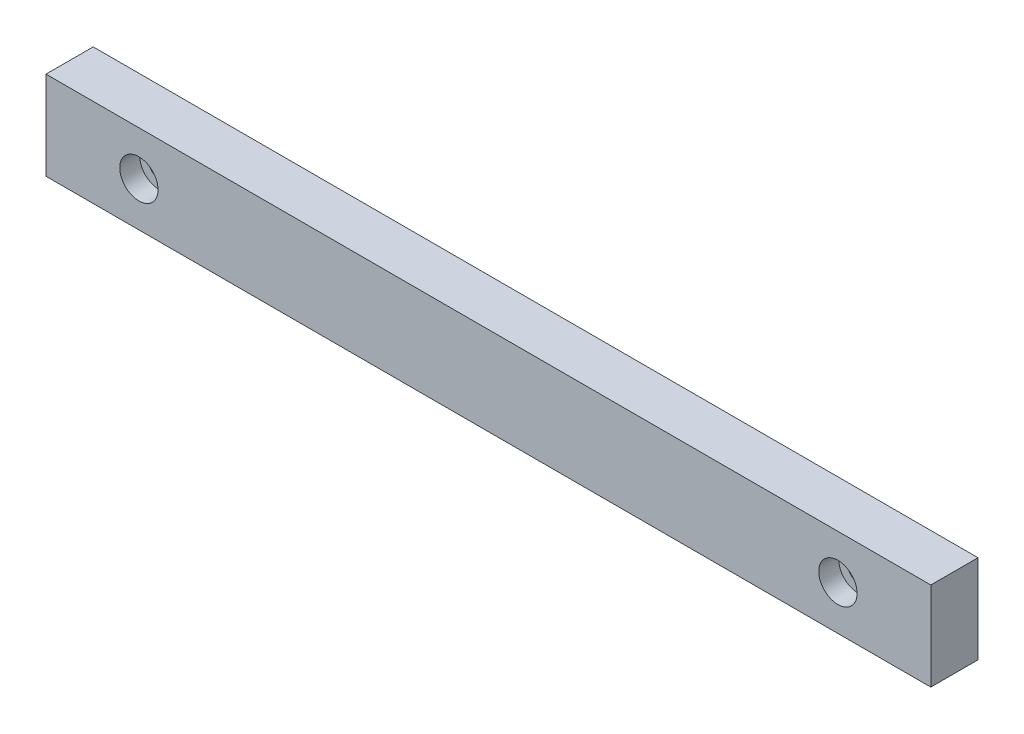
ISO-10303-21;
HEADER;
FILE_DESCRIPTION(('STEP AP214'),'2;1');
FILE_NAME('part.step','',(''),(''),'','','');
FILE_SCHEMA(('AUTOMOTIVE_DESIGN { 1 0 10303 214 1 1 1 1 }'));
ENDSEC;
DATA;
#1=APPLICATION_CONTEXT('core data for automotive mechanical design processes');
#2=APPLICATION_PROTOCOL_DEFINITION('international standard','automotive_design',2000,#1);
#3=PRODUCT_CONTEXT('',#1,'mechanical');
#4=PRODUCT('Part','Part','',(#3));
#5=PRODUCT_RELATED_PRODUCT_CATEGORY('part','',(#4));
#6=PRODUCT_DEFINITION_FORMATION('','',#4);
#7=PRODUCT_DEFINITION_CONTEXT('part definition',#1,'design');
#8=PRODUCT_DEFINITION('design','',#6,#7);
#9=PRODUCT_DEFINITION_SHAPE('','',#8);
#10=(LENGTH_UNIT() NAMED_UNIT(*) SI_UNIT(.MILLI.,.METRE.));
#11=(NAMED_UNIT(*) PLANE_ANGLE_UNIT() SI_UNIT($,.RADIAN.));
#12=(NAMED_UNIT(*) SI_UNIT($,.STERADIAN.) SOLID_ANGLE_UNIT());
#13=UNCERTAINTY_MEASURE_WITH_UNIT(LENGTH_MEASURE(1.E-05),#10,'distance_accuracy_value','');
#14=(GEOMETRIC_REPRESENTATION_CONTEXT(3) GLOBAL_UNCERTAINTY_ASSIGNED_CONTEXT((#13)) GLOBAL_UNIT_ASSIGNED_CONTEXT((#10,
#11,#12)) REPRESENTATION_CONTEXT('',''));
#15=CARTESIAN_POINT('',(0.,0.,0.));
#16=DIRECTION('',(0.,0.,1.));
#17=DIRECTION('',(1.,0.,0.));
#18=AXIS2_PLACEMENT_3D('',#15,#16,#17);
#19=CARTESIAN_POINT('',(-58.851364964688,30.5046241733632,8.));
#20=DIRECTION('',(1.,0.,0.));
#21=DIRECTION('',(0.,1.,0.));
#22=AXIS2_PLACEMENT_3D('',#19,#20,#21);
#23=PLANE('',#22);
#24=DIRECTION('',(0.,-1.,0.));
#25=VECTOR('',#24,1.);
#26=CARTESIAN_POINT('',(-58.851364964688,30.5046241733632,0.));
#27=LINE('',#26,#25);
#28=CARTESIAN_POINT('',(-58.851364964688,30.5046241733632,0.));
#29=VERTEX_POINT('',#28);
#30=CARTESIAN_POINT('',(-58.851364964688,15.5046241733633,0.));
#31=VERTEX_POINT('',#30);
#32=EDGE_CURVE('E79',#29,#31,#27,.T.);
#33=ORIENTED_EDGE('',*,*,#32,.T.);
#34=DIRECTION('',(0.,0.,-1.));
#35=VECTOR('',#34,1.);
#36=CARTESIAN_POINT('',(-58.851364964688,15.5046241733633,8.));
#37=LINE('',#36,#35);
#38=CARTESIAN_POINT('',(-58.851364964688,15.5046241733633,8.));
#39=VERTEX_POINT('',#38);
#40=EDGE_CURVE('E11',#39,#31,#37,.T.);
#41=ORIENTED_EDGE('',*,*,#40,.F.);
#42=DIRECTION('',(0.,-1.,0.));
#43=VECTOR('',#42,1.);
#44=CARTESIAN_POINT('',(-58.851364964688,30.5046241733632,8.));
#45=LINE('',#44,#43);
#46=CARTESIAN_POINT('',(-58.851364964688,30.5046241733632,8.));
#47=VERTEX_POINT('',#46);
#48=EDGE_CURVE('E67',#47,#39,#45,.T.);
#49=ORIENTED_EDGE('',*,*,#48,.F.);
#50=DIRECTION('',(0.,0.,-1.));
#51=VECTOR('',#50,1.);
#52=CARTESIAN_POINT('',(-58.851364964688,30.5046241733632,8.));
#53=LINE('',#52,#51);
#54=EDGE_CURVE('E75',#47,#29,#53,.T.);
#55=ORIENTED_EDGE('',*,*,#54,.T.);
#56=EDGE_LOOP('',(#33,#41,#49,#55));
#57=FACE_BOUND('',#56,.T.);
#58=ADVANCED_FACE('F16',(#57),#23,.F.);
#59=CARTESIAN_POINT('',(-58.851364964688,15.5046241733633,8.));
#60=DIRECTION('',(0.,1.,0.));
#61=DIRECTION('',(0.,0.,1.));
#62=AXIS2_PLACEMENT_3D('',#59,#60,#61);
#63=PLANE('',#62);
#64=DIRECTION('',(1.,0.,0.));
#65=VECTOR('',#64,1.);
#66=CARTESIAN_POINT('',(-58.851364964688,15.5046241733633,0.));
#67=LINE('',#66,#65);
#68=CARTESIAN_POINT('',(91.148635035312,15.5046241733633,0.));
#69=VERTEX_POINT('',#68);
#70=EDGE_CURVE('E71',#31,#69,#67,.T.);
#71=ORIENTED_EDGE('',*,*,#70,.T.);
#72=DIRECTION('',(0.,0.,-1.));
#73=VECTOR('',#72,1.);
#74=CARTESIAN_POINT('',(91.148635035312,15.5046241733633,8.));
#75=LINE('',#74,#73);
#76=CARTESIAN_POINT('',(91.148635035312,15.5046241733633,8.));
#77=VERTEX_POINT('',#76);
#78=EDGE_CURVE('E24',#77,#69,#75,.T.);
#79=ORIENTED_EDGE('',*,*,#78,.F.);
#80=DIRECTION('',(1.,0.,0.));
#81=VECTOR('',#80,1.);
#82=CARTESIAN_POINT('',(-58.851364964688,15.5046241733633,8.));
#83=LINE('',#82,#81);
#84=EDGE_CURVE('E62',#39,#77,#83,.T.);
#85=ORIENTED_EDGE('',*,*,#84,.F.);
#86=ORIENTED_EDGE('',*,*,#40,.T.);
#87=EDGE_LOOP('',(#71,#79,#85,#86));
#88=FACE_BOUND('',#87,.T.);
#89=ADVANCED_FACE('F70',(#88),#63,.F.);
#90=CARTESIAN_POINT('',(91.148635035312,30.5046241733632,8.));
#91=DIRECTION('',(-1.,0.,0.));
#92=DIRECTION('',(0.,-1.,0.));
#93=AXIS2_PLACEMENT_3D('',#90,#91,#92);
#94=PLANE('',#93);
#95=DIRECTION('',(0.,1.,0.));
#96=VECTOR('',#95,1.);
#97=CARTESIAN_POINT('',(91.148635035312,30.5046241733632,0.));
#98=LINE('',#97,#96);
#99=CARTESIAN_POINT('',(91.148635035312,30.5046241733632,0.));
#100=VERTEX_POINT('',#99);
#101=EDGE_CURVE('E49',#69,#100,#98,.T.);
#102=ORIENTED_EDGE('',*,*,#101,.T.);
#103=DIRECTION('',(0.,0.,-1.));
#104=VECTOR('',#103,1.);
#105=CARTESIAN_POINT('',(91.148635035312,30.5046241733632,8.));
#106=LINE('',#105,#104);
#107=CARTESIAN_POINT('',(91.148635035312,30.5046241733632,8.));
#108=VERTEX_POINT('',#107);
#109=EDGE_CURVE('E72',#108,#100,#106,.T.);
#110=ORIENTED_EDGE('',*,*,#109,.F.);
#111=DIRECTION('',(0.,1.,0.));
#112=VECTOR('',#111,1.);
#113=CARTESIAN_POINT('',(91.148635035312,30.5046241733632,8.));
#114=LINE('',#113,#112);
#115=EDGE_CURVE('E65',#77,#108,#114,.T.);
#116=ORIENTED_EDGE('',*,*,#115,.F.);
#117=ORIENTED_EDGE('',*,*,#78,.T.);
#118=EDGE_LOOP('',(#102,#110,#116,#117));
#119=FACE_BOUND('',#118,.T.);
#120=ADVANCED_FACE('F73',(#119),#94,.F.);
#121=CARTESIAN_POINT('',(-58.851364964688,30.5046241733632,8.));
#122=DIRECTION('',(0.,-1.,0.));
#123=DIRECTION('',(0.,0.,-1.));
#124=AXIS2_PLACEMENT_3D('',#121,#122,#123);
#125=PLANE('',#124);
#126=DIRECTION('',(-1.,0.,0.));
#127=VECTOR('',#126,1.);
#128=CARTESIAN_POINT('',(-58.851364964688,30.5046241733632,0.));
#129=LINE('',#128,#127);
#130=EDGE_CURVE('E55',#100,#29,#129,.T.);
#131=ORIENTED_EDGE('',*,*,#130,.T.);
#132=ORIENTED_EDGE('',*,*,#54,.F.);
#133=DIRECTION('',(-1.,0.,0.));
#134=VECTOR('',#133,1.);
#135=CARTESIAN_POINT('',(-58.851364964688,30.5046241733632,8.));
#136=LINE('',#135,#134);
#137=EDGE_CURVE('E32',#108,#47,#136,.T.);
#138=ORIENTED_EDGE('',*,*,#137,.F.);
#139=ORIENTED_EDGE('',*,*,#109,.T.);
#140=EDGE_LOOP('',(#131,#132,#138,#139));
#141=FACE_BOUND('',#140,.T.);
#142=ADVANCED_FACE('F87',(#141),#125,.F.);
#143=CARTESIAN_POINT('',(0.,0.,8.));
#144=DIRECTION('',(0.,0.,1.));
#145=DIRECTION('',(1.,0.,0.));
#146=AXIS2_PLACEMENT_3D('',#143,#144,#145);
#147=PLANE('',#146);
#148=CARTESIAN_POINT('',(-43.101364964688,23.0046241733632,8.));
#149=DIRECTION('',(0.,0.,1.));
#150=DIRECTION('',(1.,0.,0.));
#151=AXIS2_PLACEMENT_3D('',#148,#149,#150);
#152=CIRCLE('',#151,3.25);
#153=CARTESIAN_POINT('',(-39.851364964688,23.0046241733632,8.));
#154=VERTEX_POINT('',#153);
#155=EDGE_CURVE('E113',#154,#154,#152,.T.);
#156=ORIENTED_EDGE('',*,*,#155,.F.);
#157=EDGE_LOOP('',(#156));
#158=FACE_BOUND('',#157,.T.);
#159=CARTESIAN_POINT('',(75.398635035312,23.0046241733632,8.));
#160=DIRECTION('',(0.,0.,1.));
#161=DIRECTION('',(1.,0.,0.));
#162=AXIS2_PLACEMENT_3D('',#159,#160,#161);
#163=CIRCLE('',#162,3.25);
#164=CARTESIAN_POINT('',(78.648635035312,23.0046241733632,8.));
#165=VERTEX_POINT('',#164);
#166=EDGE_CURVE('E101',#165,#165,#163,.T.);
#167=ORIENTED_EDGE('',*,*,#166,.F.);
#168=EDGE_LOOP('',(#167));
#169=FACE_BOUND('',#168,.T.);
#170=ORIENTED_EDGE('',*,*,#48,.T.);
#171=ORIENTED_EDGE('',*,*,#84,.T.);
#172=ORIENTED_EDGE('',*,*,#115,.T.);
#173=ORIENTED_EDGE('',*,*,#137,.T.);
#174=EDGE_LOOP('',(#170,#171,#172,#173));
#175=FACE_BOUND('',#174,.T.);
#176=ADVANCED_FACE('F63',(#158,#169,#175),#147,.T.);
#177=CARTESIAN_POINT('',(0.,0.,0.));
#178=DIRECTION('',(0.,0.,1.));
#179=DIRECTION('',(1.,0.,0.));
#180=AXIS2_PLACEMENT_3D('',#177,#178,#179);
#181=PLANE('',#180);
#182=CARTESIAN_POINT('',(-43.101364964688,23.0046241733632,0.));
#183=DIRECTION('',(0.,0.,1.));
#184=DIRECTION('',(1.,0.,0.));
#185=AXIS2_PLACEMENT_3D('',#182,#183,#184);
#186=CIRCLE('',#185,1.7);
#187=CARTESIAN_POINT('',(-41.401364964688,23.0046241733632,0.));
#188=VERTEX_POINT('',#187);
#189=EDGE_CURVE('E104',#188,#188,#186,.T.);
#190=ORIENTED_EDGE('',*,*,#189,.T.);
#191=EDGE_LOOP('',(#190));
#192=FACE_BOUND('',#191,.T.);
#193=CARTESIAN_POINT('',(75.398635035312,23.0046241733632,0.));
#194=DIRECTION('',(0.,0.,1.));
#195=DIRECTION('',(1.,0.,0.));
#196=AXIS2_PLACEMENT_3D('',#193,#194,#195);
#197=CIRCLE('',#196,1.7);
#198=CARTESIAN_POINT('',(77.098635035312,23.0046241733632,0.));
#199=VERTEX_POINT('',#198);
#200=EDGE_CURVE('E82',#199,#199,#197,.T.);
#201=ORIENTED_EDGE('',*,*,#200,.T.);
#202=EDGE_LOOP('',(#201));
#203=FACE_BOUND('',#202,.T.);
#204=ORIENTED_EDGE('',*,*,#32,.F.);
#205=ORIENTED_EDGE('',*,*,#130,.F.);
#206=ORIENTED_EDGE('',*,*,#101,.F.);
#207=ORIENTED_EDGE('',*,*,#70,.F.);
#208=EDGE_LOOP('',(#204,#205,#206,#207));
#209=FACE_BOUND('',#208,.T.);
#210=ADVANCED_FACE('F90',(#192,#203,#209),#181,.F.);
#211=CARTESIAN_POINT('',(75.398635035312,23.0046241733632,8.));
#212=DIRECTION('',(0.,0.,1.));
#213=DIRECTION('',(1.,0.,0.));
#214=AXIS2_PLACEMENT_3D('',#211,#212,#213);
#215=CYLINDRICAL_SURFACE('',#214,1.7);
#216=ORIENTED_EDGE('',*,*,#200,.F.);
#217=EDGE_LOOP('',(#216));
#218=FACE_BOUND('',#217,.T.);
#219=CARTESIAN_POINT('',(75.398635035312,23.0046241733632,4.6));
#220=DIRECTION('',(0.,0.,1.));
#221=DIRECTION('',(1.,0.,0.));
#222=AXIS2_PLACEMENT_3D('',#219,#220,#221);
#223=CIRCLE('',#222,1.7);
#224=CARTESIAN_POINT('',(77.098635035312,23.0046241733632,4.6));
#225=VERTEX_POINT('',#224);
#226=EDGE_CURVE('E95',#225,#225,#223,.T.);
#227=ORIENTED_EDGE('',*,*,#226,.T.);
#228=EDGE_LOOP('',(#227));
#229=FACE_BOUND('',#228,.T.);
#230=ADVANCED_FACE('F139',(#218,#229),#215,.F.);
#231=CARTESIAN_POINT('',(77.098635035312,23.0046241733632,4.6));
#232=DIRECTION('',(0.,0.,-1.));
#233=DIRECTION('',(-1.,0.,0.));
#234=AXIS2_PLACEMENT_3D('',#231,#232,#233);
#235=PLANE('',#234);
#236=ORIENTED_EDGE('',*,*,#226,.F.);
#237=EDGE_LOOP('',(#236));
#238=FACE_BOUND('',#237,.T.);
#239=CARTESIAN_POINT('',(75.398635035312,23.0046241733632,4.6));
#240=DIRECTION('',(0.,0.,1.));
#241=DIRECTION('',(1.,0.,0.));
#242=AXIS2_PLACEMENT_3D('',#239,#240,#241);
#243=CIRCLE('',#242,3.25);
#244=CARTESIAN_POINT('',(78.648635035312,23.0046241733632,4.6));
#245=VERTEX_POINT('',#244);
#246=EDGE_CURVE('E98',#245,#245,#243,.T.);
#247=ORIENTED_EDGE('',*,*,#246,.T.);
#248=EDGE_LOOP('',(#247));
#249=FACE_BOUND('',#248,.T.);
#250=ADVANCED_FACE('F127',(#238,#249),#235,.F.);
#251=CARTESIAN_POINT('',(75.398635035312,23.0046241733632,8.));
#252=DIRECTION('',(0.,0.,1.));
#253=DIRECTION('',(1.,0.,0.));
#254=AXIS2_PLACEMENT_3D('',#251,#252,#253);
#255=CYLINDRICAL_SURFACE('',#254,3.25);
#256=ORIENTED_EDGE('',*,*,#246,.F.);
#257=EDGE_LOOP('',(#256));
#258=FACE_BOUND('',#257,.T.);
#259=ORIENTED_EDGE('',*,*,#166,.T.);
#260=EDGE_LOOP('',(#259));
#261=FACE_BOUND('',#260,.T.);
#262=ADVANCED_FACE('F124',(#258,#261),#255,.F.);
#263=CARTESIAN_POINT('',(-43.101364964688,23.0046241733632,8.));
#264=DIRECTION('',(0.,0.,1.));
#265=DIRECTION('',(1.,0.,0.));
#266=AXIS2_PLACEMENT_3D('',#263,#264,#265);
#267=CYLINDRICAL_SURFACE('',#266,1.7);
#268=ORIENTED_EDGE('',*,*,#189,.F.);
#269=EDGE_LOOP('',(#268));
#270=FACE_BOUND('',#269,.T.);
#271=CARTESIAN_POINT('',(-43.101364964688,23.0046241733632,4.6));
#272=DIRECTION('',(0.,0.,1.));
#273=DIRECTION('',(1.,0.,0.));
#274=AXIS2_PLACEMENT_3D('',#271,#272,#273);
#275=CIRCLE('',#274,1.7);
#276=CARTESIAN_POINT('',(-41.401364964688,23.0046241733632,4.6));
#277=VERTEX_POINT('',#276);
#278=EDGE_CURVE('E107',#277,#277,#275,.T.);
#279=ORIENTED_EDGE('',*,*,#278,.T.);
#280=EDGE_LOOP('',(#279));
#281=FACE_BOUND('',#280,.T.);
#282=ADVANCED_FACE('F126',(#270,#281),#267,.F.);
#283=CARTESIAN_POINT('',(-41.401364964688,23.0046241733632,4.6));
#284=DIRECTION('',(0.,0.,-1.));
#285=DIRECTION('',(-1.,0.,0.));
#286=AXIS2_PLACEMENT_3D('',#283,#284,#285);
#287=PLANE('',#286);
#288=ORIENTED_EDGE('',*,*,#278,.F.);
#289=EDGE_LOOP('',(#288));
#290=FACE_BOUND('',#289,.T.);
#291=CARTESIAN_POINT('',(-43.101364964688,23.0046241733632,4.6));
#292=DIRECTION('',(0.,0.,1.));
#293=DIRECTION('',(1.,0.,0.));
#294=AXIS2_PLACEMENT_3D('',#291,#292,#293);
#295=CIRCLE('',#294,3.25);
#296=CARTESIAN_POINT('',(-39.851364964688,23.0046241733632,4.6));
#297=VERTEX_POINT('',#296);
#298=EDGE_CURVE('E110',#297,#297,#295,.T.);
#299=ORIENTED_EDGE('',*,*,#298,.T.);
#300=EDGE_LOOP('',(#299));
#301=FACE_BOUND('',#300,.T.);
#302=ADVANCED_FACE('F136',(#290,#301),#287,.F.);
#303=CARTESIAN_POINT('',(-43.101364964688,23.0046241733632,8.));
#304=DIRECTION('',(0.,0.,1.));
#305=DIRECTION('',(1.,0.,0.));
#306=AXIS2_PLACEMENT_3D('',#303,#304,#305);
#307=CYLINDRICAL_SURFACE('',#306,3.25);
#308=ORIENTED_EDGE('',*,*,#298,.F.);
#309=EDGE_LOOP('',(#308));
#310=FACE_BOUND('',#309,.T.);
#311=ORIENTED_EDGE('',*,*,#155,.T.);
#312=EDGE_LOOP('',(#311));
#313=FACE_BOUND('',#312,.T.);
#314=ADVANCED_FACE('F117',(#310,#313),#307,.F.);
#315=CLOSED_SHELL('',(#58,#89,#120,#142,#176,#210,#230,#250,#262,#282,#302,#314));
#316=MANIFOLD_SOLID_BREP('B1',#315);
#317=ADVANCED_BREP_SHAPE_REPRESENTATION('',(#18,#316),#14);
#318=SHAPE_DEFINITION_REPRESENTATION(#9,#317);
ENDSEC;
END-ISO-10303-21;
